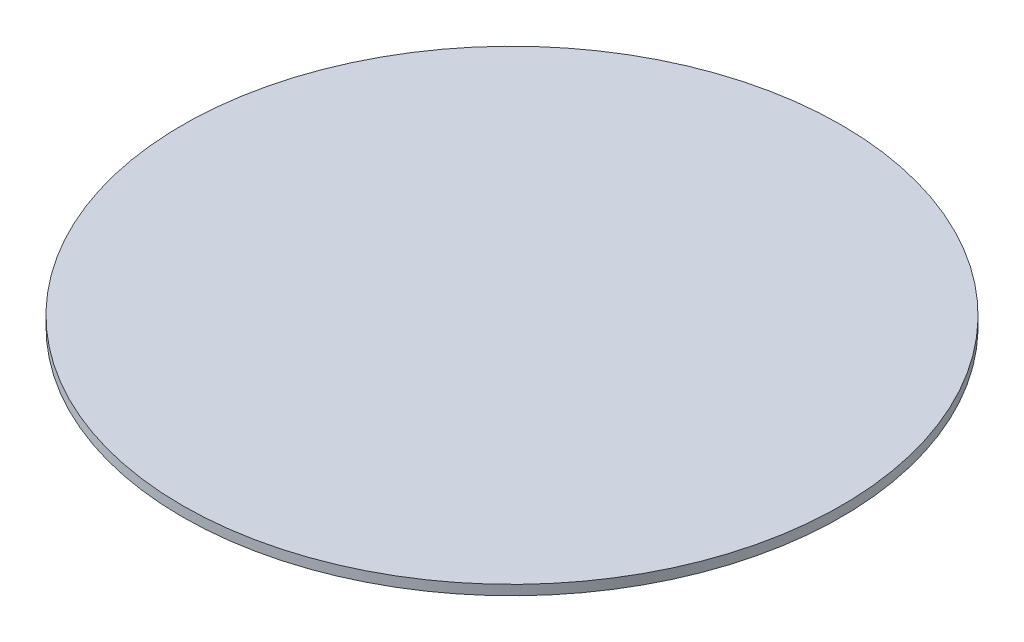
from build123d import *

# Parameters (mm, degrees)
ESQUISSE1_R      = 100
EXTRUSION1_DEPTH = 3


with BuildPart() as part:
    # Esquisse1 → Extrusion1 (new body)
    with BuildSketch(Plane(origin=(0, 0, 0), x_dir=(1, 0, 0), z_dir=(0, 1, 0))):
        with Locations(Location((0, 0, 0), (0, 0, 270))):
            Circle(ESQUISSE1_R)
    extrude(amount=EXTRUSION1_DEPTH)


solid = part.part
